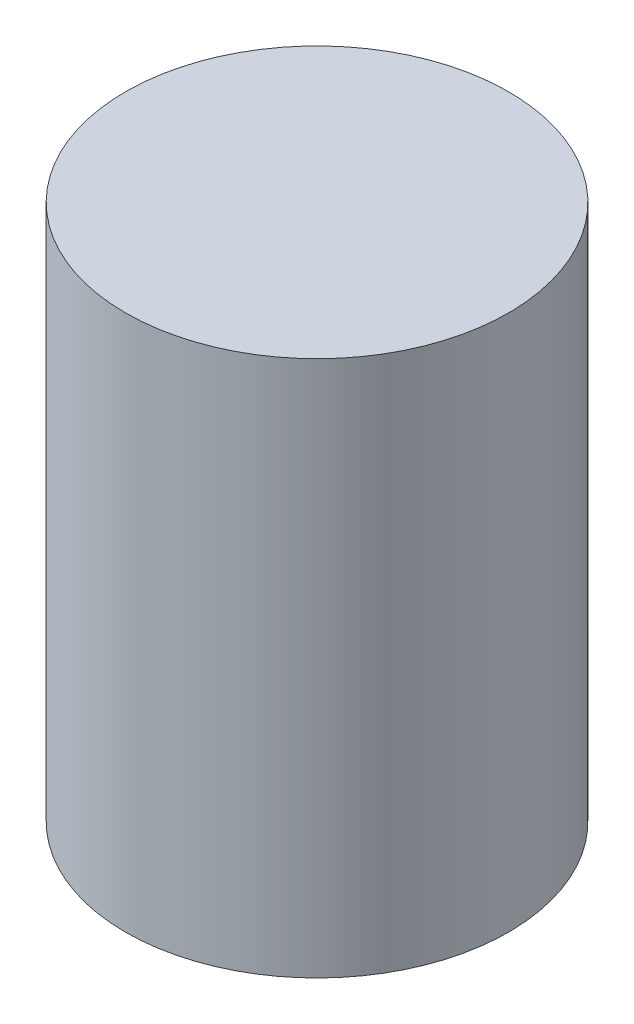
from build123d import *

# Parameters (mm, degrees)
SKETCH1_R      = 31.75
EXTRUDE1_DEPTH = 88.9


with BuildPart() as part:
    # Sketch1 → Extrude1 (new body)
    with BuildSketch(Plane(origin=(0, 0, 0), x_dir=(1, 0, 0), z_dir=(0, 1, 0))):
        with Locations(Location((0, 0, 0), (0, 0, 270))):
            Circle(SKETCH1_R)
    extrude(amount=EXTRUDE1_DEPTH)


solid = part.part
